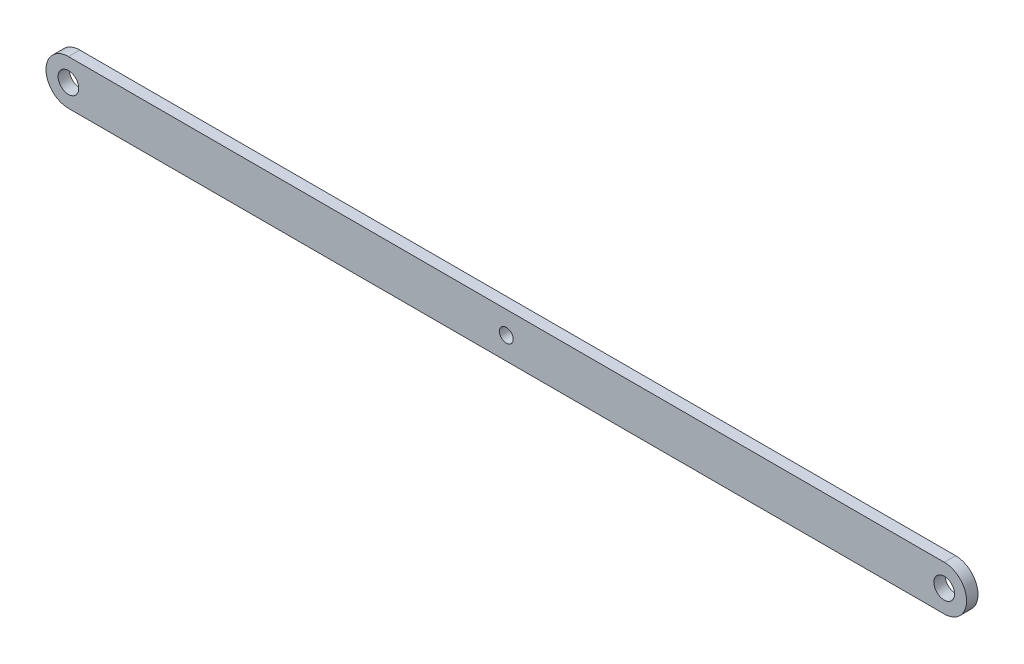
ISO-10303-21;
HEADER;
FILE_DESCRIPTION(('STEP AP214'),'2;1');
FILE_NAME('part.step','',(''),(''),'','','');
FILE_SCHEMA(('AUTOMOTIVE_DESIGN { 1 0 10303 214 1 1 1 1 }'));
ENDSEC;
DATA;
#1=APPLICATION_CONTEXT('core data for automotive mechanical design processes');
#2=APPLICATION_PROTOCOL_DEFINITION('international standard','automotive_design',2000,#1);
#3=PRODUCT_CONTEXT('',#1,'mechanical');
#4=PRODUCT('Part','Part','',(#3));
#5=PRODUCT_RELATED_PRODUCT_CATEGORY('part','',(#4));
#6=PRODUCT_DEFINITION_FORMATION('','',#4);
#7=PRODUCT_DEFINITION_CONTEXT('part definition',#1,'design');
#8=PRODUCT_DEFINITION('design','',#6,#7);
#9=PRODUCT_DEFINITION_SHAPE('','',#8);
#10=(LENGTH_UNIT() NAMED_UNIT(*) SI_UNIT(.MILLI.,.METRE.));
#11=(NAMED_UNIT(*) PLANE_ANGLE_UNIT() SI_UNIT($,.RADIAN.));
#12=(NAMED_UNIT(*) SI_UNIT($,.STERADIAN.) SOLID_ANGLE_UNIT());
#13=UNCERTAINTY_MEASURE_WITH_UNIT(LENGTH_MEASURE(1.E-05),#10,'distance_accuracy_value','');
#14=(GEOMETRIC_REPRESENTATION_CONTEXT(3) GLOBAL_UNCERTAINTY_ASSIGNED_CONTEXT((#13)) GLOBAL_UNIT_ASSIGNED_CONTEXT((#10,
#11,#12)) REPRESENTATION_CONTEXT('',''));
#15=CARTESIAN_POINT('',(0.,0.,0.));
#16=DIRECTION('',(0.,0.,1.));
#17=DIRECTION('',(1.,0.,0.));
#18=AXIS2_PLACEMENT_3D('',#15,#16,#17);
#19=CARTESIAN_POINT('',(0.,0.,3.3));
#20=DIRECTION('',(0.,0.,1.));
#21=DIRECTION('',(1.,0.,0.));
#22=AXIS2_PLACEMENT_3D('',#19,#20,#21);
#23=PLANE('',#22);
#24=CARTESIAN_POINT('',(254.,0.,3.3));
#25=DIRECTION('',(0.,0.,1.));
#26=DIRECTION('',(1.,0.,0.));
#27=AXIS2_PLACEMENT_3D('',#24,#25,#26);
#28=CIRCLE('',#27,2.99999999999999);
#29=CARTESIAN_POINT('',(257.,0.,3.3));
#30=VERTEX_POINT('',#29);
#31=EDGE_CURVE('E116',#30,#30,#28,.T.);
#32=ORIENTED_EDGE('',*,*,#31,.F.);
#33=EDGE_LOOP('',(#32));
#34=FACE_BOUND('',#33,.T.);
#35=CARTESIAN_POINT('',(0.,0.,3.3));
#36=DIRECTION('',(0.,0.,1.));
#37=DIRECTION('',(1.,0.,0.));
#38=AXIS2_PLACEMENT_3D('',#35,#36,#37);
#39=CIRCLE('',#38,6.5);
#40=CARTESIAN_POINT('',(0.,6.5,3.3));
#41=VERTEX_POINT('',#40);
#42=CARTESIAN_POINT('',(0.,-6.5,3.3));
#43=VERTEX_POINT('',#42);
#44=EDGE_CURVE('E86',#41,#43,#39,.T.);
#45=ORIENTED_EDGE('',*,*,#44,.T.);
#46=DIRECTION('',(1.,0.,0.));
#47=VECTOR('',#46,1.);
#48=CARTESIAN_POINT('',(0.,-6.5,3.3));
#49=LINE('',#48,#47);
#50=CARTESIAN_POINT('',(254.,-6.5,3.3));
#51=VERTEX_POINT('',#50);
#52=EDGE_CURVE('E81',#43,#51,#49,.T.);
#53=ORIENTED_EDGE('',*,*,#52,.T.);
#54=CARTESIAN_POINT('',(254.,0.,3.3));
#55=DIRECTION('',(0.,0.,1.));
#56=DIRECTION('',(1.,0.,0.));
#57=AXIS2_PLACEMENT_3D('',#54,#55,#56);
#58=CIRCLE('',#57,6.5);
#59=CARTESIAN_POINT('',(254.,6.5,3.3));
#60=VERTEX_POINT('',#59);
#61=EDGE_CURVE('E84',#51,#60,#58,.T.);
#62=ORIENTED_EDGE('',*,*,#61,.T.);
#63=DIRECTION('',(-1.,0.,0.));
#64=VECTOR('',#63,1.);
#65=CARTESIAN_POINT('',(0.,6.5,3.3));
#66=LINE('',#65,#64);
#67=EDGE_CURVE('E51',#60,#41,#66,.T.);
#68=ORIENTED_EDGE('',*,*,#67,.T.);
#69=EDGE_LOOP('',(#45,#53,#62,#68));
#70=FACE_BOUND('',#69,.T.);
#71=CARTESIAN_POINT('',(0.,0.,3.3));
#72=DIRECTION('',(0.,0.,1.));
#73=DIRECTION('',(1.,0.,0.));
#74=AXIS2_PLACEMENT_3D('',#71,#72,#73);
#75=CIRCLE('',#74,3.);
#76=CARTESIAN_POINT('',(3.,0.,3.3));
#77=VERTEX_POINT('',#76);
#78=EDGE_CURVE('E101',#77,#77,#75,.T.);
#79=ORIENTED_EDGE('',*,*,#78,.F.);
#80=EDGE_LOOP('',(#79));
#81=FACE_BOUND('',#80,.T.);
#82=CARTESIAN_POINT('',(127.,0.,3.3));
#83=DIRECTION('',(0.,0.,1.));
#84=DIRECTION('',(1.,0.,0.));
#85=AXIS2_PLACEMENT_3D('',#82,#83,#84);
#86=CIRCLE('',#85,2.);
#87=CARTESIAN_POINT('',(129.,0.,3.3));
#88=VERTEX_POINT('',#87);
#89=EDGE_CURVE('E122',#88,#88,#86,.T.);
#90=ORIENTED_EDGE('',*,*,#89,.F.);
#91=EDGE_LOOP('',(#90));
#92=FACE_BOUND('',#91,.T.);
#93=ADVANCED_FACE('F34',(#34,#70,#81,#92),#23,.T.);
#94=CARTESIAN_POINT('',(0.,0.,0.));
#95=DIRECTION('',(0.,0.,1.));
#96=DIRECTION('',(1.,0.,0.));
#97=AXIS2_PLACEMENT_3D('',#94,#95,#96);
#98=PLANE('',#97);
#99=CARTESIAN_POINT('',(0.,0.,0.));
#100=DIRECTION('',(0.,0.,1.));
#101=DIRECTION('',(1.,0.,0.));
#102=AXIS2_PLACEMENT_3D('',#99,#100,#101);
#103=CIRCLE('',#102,6.5);
#104=CARTESIAN_POINT('',(0.,6.5,0.));
#105=VERTEX_POINT('',#104);
#106=CARTESIAN_POINT('',(0.,-6.5,0.));
#107=VERTEX_POINT('',#106);
#108=EDGE_CURVE('E98',#105,#107,#103,.T.);
#109=ORIENTED_EDGE('',*,*,#108,.F.);
#110=DIRECTION('',(-1.,0.,0.));
#111=VECTOR('',#110,1.);
#112=CARTESIAN_POINT('',(0.,6.5,0.));
#113=LINE('',#112,#111);
#114=CARTESIAN_POINT('',(254.,6.5,0.));
#115=VERTEX_POINT('',#114);
#116=EDGE_CURVE('E74',#115,#105,#113,.T.);
#117=ORIENTED_EDGE('',*,*,#116,.F.);
#118=CARTESIAN_POINT('',(254.,0.,0.));
#119=DIRECTION('',(0.,0.,1.));
#120=DIRECTION('',(1.,0.,0.));
#121=AXIS2_PLACEMENT_3D('',#118,#119,#120);
#122=CIRCLE('',#121,6.5);
#123=CARTESIAN_POINT('',(254.,-6.5,0.));
#124=VERTEX_POINT('',#123);
#125=EDGE_CURVE('E68',#124,#115,#122,.T.);
#126=ORIENTED_EDGE('',*,*,#125,.F.);
#127=DIRECTION('',(1.,0.,0.));
#128=VECTOR('',#127,1.);
#129=CARTESIAN_POINT('',(0.,-6.5,0.));
#130=LINE('',#129,#128);
#131=EDGE_CURVE('E90',#107,#124,#130,.T.);
#132=ORIENTED_EDGE('',*,*,#131,.F.);
#133=EDGE_LOOP('',(#109,#117,#126,#132));
#134=FACE_BOUND('',#133,.T.);
#135=CARTESIAN_POINT('',(0.,0.,0.));
#136=DIRECTION('',(0.,0.,1.));
#137=DIRECTION('',(1.,0.,0.));
#138=AXIS2_PLACEMENT_3D('',#135,#136,#137);
#139=CIRCLE('',#138,3.);
#140=CARTESIAN_POINT('',(3.,0.,0.));
#141=VERTEX_POINT('',#140);
#142=EDGE_CURVE('E113',#141,#141,#139,.T.);
#143=ORIENTED_EDGE('',*,*,#142,.T.);
#144=EDGE_LOOP('',(#143));
#145=FACE_BOUND('',#144,.T.);
#146=CARTESIAN_POINT('',(254.,0.,0.));
#147=DIRECTION('',(0.,0.,1.));
#148=DIRECTION('',(1.,0.,0.));
#149=AXIS2_PLACEMENT_3D('',#146,#147,#148);
#150=CIRCLE('',#149,2.99999999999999);
#151=CARTESIAN_POINT('',(257.,0.,0.));
#152=VERTEX_POINT('',#151);
#153=EDGE_CURVE('E119',#152,#152,#150,.T.);
#154=ORIENTED_EDGE('',*,*,#153,.T.);
#155=EDGE_LOOP('',(#154));
#156=FACE_BOUND('',#155,.T.);
#157=CARTESIAN_POINT('',(127.,0.,0.));
#158=DIRECTION('',(0.,0.,1.));
#159=DIRECTION('',(1.,0.,0.));
#160=AXIS2_PLACEMENT_3D('',#157,#158,#159);
#161=CIRCLE('',#160,2.);
#162=CARTESIAN_POINT('',(129.,0.,0.));
#163=VERTEX_POINT('',#162);
#164=EDGE_CURVE('E125',#163,#163,#161,.T.);
#165=ORIENTED_EDGE('',*,*,#164,.T.);
#166=EDGE_LOOP('',(#165));
#167=FACE_BOUND('',#166,.T.);
#168=ADVANCED_FACE('F109',(#134,#145,#156,#167),#98,.F.);
#169=CARTESIAN_POINT('',(0.,0.,3.3));
#170=DIRECTION('',(0.,0.,-1.));
#171=DIRECTION('',(-1.,0.,0.));
#172=AXIS2_PLACEMENT_3D('',#169,#170,#171);
#173=CYLINDRICAL_SURFACE('',#172,6.5);
#174=ORIENTED_EDGE('',*,*,#108,.T.);
#175=DIRECTION('',(0.,0.,-1.));
#176=VECTOR('',#175,1.);
#177=CARTESIAN_POINT('',(0.,-6.5,3.3));
#178=LINE('',#177,#176);
#179=EDGE_CURVE('E11',#43,#107,#178,.T.);
#180=ORIENTED_EDGE('',*,*,#179,.F.);
#181=ORIENTED_EDGE('',*,*,#44,.F.);
#182=DIRECTION('',(0.,0.,-1.));
#183=VECTOR('',#182,1.);
#184=CARTESIAN_POINT('',(0.,6.5,3.3));
#185=LINE('',#184,#183);
#186=EDGE_CURVE('E94',#41,#105,#185,.T.);
#187=ORIENTED_EDGE('',*,*,#186,.T.);
#188=EDGE_LOOP('',(#174,#180,#181,#187));
#189=FACE_BOUND('',#188,.T.);
#190=ADVANCED_FACE('F36',(#189),#173,.T.);
#191=CARTESIAN_POINT('',(0.,-6.5,3.3));
#192=DIRECTION('',(0.,1.,0.));
#193=DIRECTION('',(0.,0.,1.));
#194=AXIS2_PLACEMENT_3D('',#191,#192,#193);
#195=PLANE('',#194);
#196=ORIENTED_EDGE('',*,*,#131,.T.);
#197=DIRECTION('',(0.,0.,-1.));
#198=VECTOR('',#197,1.);
#199=CARTESIAN_POINT('',(254.,-6.5,3.3));
#200=LINE('',#199,#198);
#201=EDGE_CURVE('E43',#51,#124,#200,.T.);
#202=ORIENTED_EDGE('',*,*,#201,.F.);
#203=ORIENTED_EDGE('',*,*,#52,.F.);
#204=ORIENTED_EDGE('',*,*,#179,.T.);
#205=EDGE_LOOP('',(#196,#202,#203,#204));
#206=FACE_BOUND('',#205,.T.);
#207=ADVANCED_FACE('F89',(#206),#195,.F.);
#208=CARTESIAN_POINT('',(254.,0.,3.3));
#209=DIRECTION('',(0.,0.,-1.));
#210=DIRECTION('',(-1.,0.,0.));
#211=AXIS2_PLACEMENT_3D('',#208,#209,#210);
#212=CYLINDRICAL_SURFACE('',#211,6.5);
#213=ORIENTED_EDGE('',*,*,#125,.T.);
#214=DIRECTION('',(0.,0.,-1.));
#215=VECTOR('',#214,1.);
#216=CARTESIAN_POINT('',(254.,6.5,3.3));
#217=LINE('',#216,#215);
#218=EDGE_CURVE('E91',#60,#115,#217,.T.);
#219=ORIENTED_EDGE('',*,*,#218,.F.);
#220=ORIENTED_EDGE('',*,*,#61,.F.);
#221=ORIENTED_EDGE('',*,*,#201,.T.);
#222=EDGE_LOOP('',(#213,#219,#220,#221));
#223=FACE_BOUND('',#222,.T.);
#224=ADVANCED_FACE('F92',(#223),#212,.T.);
#225=CARTESIAN_POINT('',(0.,6.5,3.3));
#226=DIRECTION('',(0.,-1.,0.));
#227=DIRECTION('',(0.,0.,-1.));
#228=AXIS2_PLACEMENT_3D('',#225,#226,#227);
#229=PLANE('',#228);
#230=ORIENTED_EDGE('',*,*,#116,.T.);
#231=ORIENTED_EDGE('',*,*,#186,.F.);
#232=ORIENTED_EDGE('',*,*,#67,.F.);
#233=ORIENTED_EDGE('',*,*,#218,.T.);
#234=EDGE_LOOP('',(#230,#231,#232,#233));
#235=FACE_BOUND('',#234,.T.);
#236=ADVANCED_FACE('F106',(#235),#229,.F.);
#237=CARTESIAN_POINT('',(0.,0.,3.3));
#238=DIRECTION('',(0.,0.,-1.));
#239=DIRECTION('',(-1.,0.,0.));
#240=AXIS2_PLACEMENT_3D('',#237,#238,#239);
#241=CYLINDRICAL_SURFACE('',#240,3.);
#242=ORIENTED_EDGE('',*,*,#78,.T.);
#243=EDGE_LOOP('',(#242));
#244=FACE_BOUND('',#243,.T.);
#245=ORIENTED_EDGE('',*,*,#142,.F.);
#246=EDGE_LOOP('',(#245));
#247=FACE_BOUND('',#246,.T.);
#248=ADVANCED_FACE('F143',(#244,#247),#241,.F.);
#249=CARTESIAN_POINT('',(254.,0.,3.3));
#250=DIRECTION('',(0.,0.,-1.));
#251=DIRECTION('',(-1.,0.,0.));
#252=AXIS2_PLACEMENT_3D('',#249,#250,#251);
#253=CYLINDRICAL_SURFACE('',#252,2.99999999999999);
#254=ORIENTED_EDGE('',*,*,#31,.T.);
#255=EDGE_LOOP('',(#254));
#256=FACE_BOUND('',#255,.T.);
#257=ORIENTED_EDGE('',*,*,#153,.F.);
#258=EDGE_LOOP('',(#257));
#259=FACE_BOUND('',#258,.T.);
#260=ADVANCED_FACE('F189',(#256,#259),#253,.F.);
#261=CARTESIAN_POINT('',(127.,0.,3.3));
#262=DIRECTION('',(0.,0.,-1.));
#263=DIRECTION('',(-1.,0.,0.));
#264=AXIS2_PLACEMENT_3D('',#261,#262,#263);
#265=CYLINDRICAL_SURFACE('',#264,2.);
#266=ORIENTED_EDGE('',*,*,#89,.T.);
#267=EDGE_LOOP('',(#266));
#268=FACE_BOUND('',#267,.T.);
#269=ORIENTED_EDGE('',*,*,#164,.F.);
#270=EDGE_LOOP('',(#269));
#271=FACE_BOUND('',#270,.T.);
#272=ADVANCED_FACE('F131',(#268,#271),#265,.F.);
#273=CLOSED_SHELL('',(#93,#168,#190,#207,#224,#236,#248,#260,#272));
#274=MANIFOLD_SOLID_BREP('B2',#273);
#275=ADVANCED_BREP_SHAPE_REPRESENTATION('',(#18,#274),#14);
#276=SHAPE_DEFINITION_REPRESENTATION(#9,#275);
ENDSEC;
END-ISO-10303-21;
